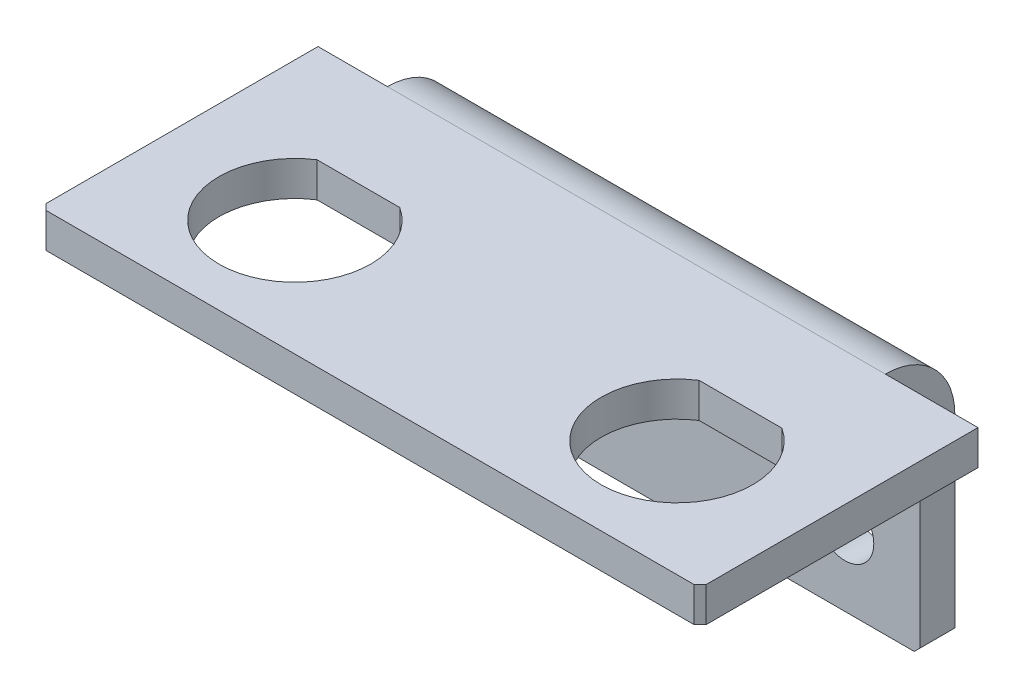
ISO-10303-21;
HEADER;
FILE_DESCRIPTION(('STEP AP214'),'2;1');
FILE_NAME('part.step','',(''),(''),'','','');
FILE_SCHEMA(('AUTOMOTIVE_DESIGN { 1 0 10303 214 1 1 1 1 }'));
ENDSEC;
DATA;
#1=APPLICATION_CONTEXT('core data for automotive mechanical design processes');
#2=APPLICATION_PROTOCOL_DEFINITION('international standard','automotive_design',2000,#1);
#3=PRODUCT_CONTEXT('',#1,'mechanical');
#4=PRODUCT('Part','Part','',(#3));
#5=PRODUCT_RELATED_PRODUCT_CATEGORY('part','',(#4));
#6=PRODUCT_DEFINITION_FORMATION('','',#4);
#7=PRODUCT_DEFINITION_CONTEXT('part definition',#1,'design');
#8=PRODUCT_DEFINITION('design','',#6,#7);
#9=PRODUCT_DEFINITION_SHAPE('','',#8);
#10=(LENGTH_UNIT() NAMED_UNIT(*) SI_UNIT(.MILLI.,.METRE.));
#11=(NAMED_UNIT(*) PLANE_ANGLE_UNIT() SI_UNIT($,.RADIAN.));
#12=(NAMED_UNIT(*) SI_UNIT($,.STERADIAN.) SOLID_ANGLE_UNIT());
#13=UNCERTAINTY_MEASURE_WITH_UNIT(LENGTH_MEASURE(1.E-05),#10,'distance_accuracy_value','');
#14=(GEOMETRIC_REPRESENTATION_CONTEXT(3) GLOBAL_UNCERTAINTY_ASSIGNED_CONTEXT((#13)) GLOBAL_UNIT_ASSIGNED_CONTEXT((#10,
#11,#12)) REPRESENTATION_CONTEXT('',''));
#15=CARTESIAN_POINT('',(0.,0.,0.));
#16=DIRECTION('',(0.,0.,1.));
#17=DIRECTION('',(1.,0.,0.));
#18=AXIS2_PLACEMENT_3D('',#15,#16,#17);
#19=CARTESIAN_POINT('',(21.373,0.127,-0.75));
#20=DIRECTION('',(0.707106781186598,-0.707106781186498,0.));
#21=DIRECTION('',(0.707106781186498,0.707106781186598,0.));
#22=AXIS2_PLACEMENT_3D('',#19,#20,#21);
#23=PLANE('',#22);
#24=DIRECTION('',(0.,0.,-1.));
#25=VECTOR('',#24,1.);
#26=CARTESIAN_POINT('',(21.5,0.254,-0.75));
#27=LINE('',#26,#25);
#28=CARTESIAN_POINT('',(21.5,0.254000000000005,0.));
#29=VERTEX_POINT('',#28);
#30=CARTESIAN_POINT('',(21.5,0.254,-1.5));
#31=VERTEX_POINT('',#30);
#32=EDGE_CURVE('E139',#29,#31,#27,.T.);
#33=ORIENTED_EDGE('',*,*,#32,.F.);
#34=DIRECTION('',(0.707106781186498,0.707106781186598,0.));
#35=VECTOR('',#34,1.);
#36=CARTESIAN_POINT('',(21.373,0.127,0.));
#37=LINE('',#36,#35);
#38=CARTESIAN_POINT('',(21.246,0.,0.));
#39=VERTEX_POINT('',#38);
#40=EDGE_CURVE('E144',#29,#39,#37,.F.);
#41=ORIENTED_EDGE('',*,*,#40,.T.);
#42=DIRECTION('',(0.,0.,-1.));
#43=VECTOR('',#42,1.);
#44=CARTESIAN_POINT('',(21.246,0.,-0.75));
#45=LINE('',#44,#43);
#46=CARTESIAN_POINT('',(21.246,0.,-1.5));
#47=VERTEX_POINT('',#46);
#48=EDGE_CURVE('E162',#47,#39,#45,.F.);
#49=ORIENTED_EDGE('',*,*,#48,.F.);
#50=DIRECTION('',(0.707106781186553,0.707106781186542,0.));
#51=VECTOR('',#50,1.);
#52=CARTESIAN_POINT('',(21.246,0.,-1.5));
#53=LINE('',#52,#51);
#54=EDGE_CURVE('E148',#47,#31,#53,.T.);
#55=ORIENTED_EDGE('',*,*,#54,.T.);
#56=EDGE_LOOP('',(#33,#41,#49,#55));
#57=FACE_BOUND('',#56,.T.);
#58=ADVANCED_FACE('F16',(#57),#23,.T.);
#59=CARTESIAN_POINT('',(0.127,0.127,-0.75));
#60=DIRECTION('',(-0.707106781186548,-0.707106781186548,0.));
#61=DIRECTION('',(0.707106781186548,-0.707106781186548,0.));
#62=AXIS2_PLACEMENT_3D('',#59,#60,#61);
#63=PLANE('',#62);
#64=DIRECTION('',(0.,0.,-1.));
#65=VECTOR('',#64,1.);
#66=CARTESIAN_POINT('',(0.254000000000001,0.,-0.75));
#67=LINE('',#66,#65);
#68=CARTESIAN_POINT('',(0.254,0.,0.));
#69=VERTEX_POINT('',#68);
#70=CARTESIAN_POINT('',(0.254,0.,-1.5));
#71=VERTEX_POINT('',#70);
#72=EDGE_CURVE('E157',#69,#71,#67,.T.);
#73=ORIENTED_EDGE('',*,*,#72,.F.);
#74=DIRECTION('',(0.707106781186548,-0.707106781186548,0.));
#75=VECTOR('',#74,1.);
#76=CARTESIAN_POINT('',(0.127,0.127,0.));
#77=LINE('',#76,#75);
#78=CARTESIAN_POINT('',(0.,0.254,0.));
#79=VERTEX_POINT('',#78);
#80=EDGE_CURVE('E147',#69,#79,#77,.F.);
#81=ORIENTED_EDGE('',*,*,#80,.T.);
#82=DIRECTION('',(0.,0.,1.));
#83=VECTOR('',#82,1.);
#84=CARTESIAN_POINT('',(0.,0.254,-0.75));
#85=LINE('',#84,#83);
#86=CARTESIAN_POINT('',(0.,0.254,-1.5));
#87=VERTEX_POINT('',#86);
#88=EDGE_CURVE('E107',#87,#79,#85,.T.);
#89=ORIENTED_EDGE('',*,*,#88,.F.);
#90=DIRECTION('',(0.707106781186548,-0.707106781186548,0.));
#91=VECTOR('',#90,1.);
#92=CARTESIAN_POINT('',(0.,0.254,-1.5));
#93=LINE('',#92,#91);
#94=EDGE_CURVE('E152',#87,#71,#93,.T.);
#95=ORIENTED_EDGE('',*,*,#94,.T.);
#96=EDGE_LOOP('',(#73,#81,#89,#95));
#97=FACE_BOUND('',#96,.T.);
#98=ADVANCED_FACE('F216',(#97),#63,.T.);
#99=CARTESIAN_POINT('',(0.,0.,-1.5));
#100=DIRECTION('',(0.,0.,1.));
#101=DIRECTION('',(1.,0.,0.));
#102=AXIS2_PLACEMENT_3D('',#99,#100,#101);
#103=PLANE('',#102);
#104=CARTESIAN_POINT('',(3.25,3.15,-1.5));
#105=DIRECTION('',(0.,0.,1.));
#106=DIRECTION('',(1.,0.,0.));
#107=AXIS2_PLACEMENT_3D('',#104,#105,#106);
#108=CIRCLE('',#107,1.25);
#109=CARTESIAN_POINT('',(4.5,3.15,-1.5));
#110=VERTEX_POINT('',#109);
#111=EDGE_CURVE('E194',#110,#110,#108,.T.);
#112=ORIENTED_EDGE('',*,*,#111,.T.);
#113=EDGE_LOOP('',(#112));
#114=FACE_BOUND('',#113,.T.);
#115=CARTESIAN_POINT('',(18.25,3.15,-1.5));
#116=DIRECTION('',(0.,0.,1.));
#117=DIRECTION('',(1.,0.,0.));
#118=AXIS2_PLACEMENT_3D('',#115,#116,#117);
#119=CIRCLE('',#118,1.25);
#120=CARTESIAN_POINT('',(19.5,3.15,-1.5));
#121=VERTEX_POINT('',#120);
#122=EDGE_CURVE('E19',#121,#121,#119,.T.);
#123=ORIENTED_EDGE('',*,*,#122,.T.);
#124=EDGE_LOOP('',(#123));
#125=FACE_BOUND('',#124,.T.);
#126=DIRECTION('',(0.,1.,0.));
#127=VECTOR('',#126,1.);
#128=CARTESIAN_POINT('',(0.,5.625,-1.5));
#129=LINE('',#128,#127);
#130=CARTESIAN_POINT('',(0.,8.25,-1.5));
#131=VERTEX_POINT('',#130);
#132=EDGE_CURVE('E138',#131,#87,#129,.F.);
#133=ORIENTED_EDGE('',*,*,#132,.F.);
#134=DIRECTION('',(-1.,0.,0.));
#135=VECTOR('',#134,1.);
#136=CARTESIAN_POINT('',(21.5,8.25,-1.5));
#137=LINE('',#136,#135);
#138=CARTESIAN_POINT('',(21.5,8.25,-1.5));
#139=VERTEX_POINT('',#138);
#140=EDGE_CURVE('E196',#139,#131,#137,.T.);
#141=ORIENTED_EDGE('',*,*,#140,.F.);
#142=DIRECTION('',(0.,1.,0.));
#143=VECTOR('',#142,1.);
#144=CARTESIAN_POINT('',(21.5,7.803097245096,-1.5));
#145=LINE('',#144,#143);
#146=EDGE_CURVE('E135',#139,#31,#145,.F.);
#147=ORIENTED_EDGE('',*,*,#146,.T.);
#148=ORIENTED_EDGE('',*,*,#54,.F.);
#149=DIRECTION('',(1.,0.,0.));
#150=VECTOR('',#149,1.);
#151=CARTESIAN_POINT('',(10.75,0.,-1.5));
#152=LINE('',#151,#150);
#153=EDGE_CURVE('E151',#71,#47,#152,.T.);
#154=ORIENTED_EDGE('',*,*,#153,.F.);
#155=ORIENTED_EDGE('',*,*,#94,.F.);
#156=EDGE_LOOP('',(#133,#141,#147,#148,#154,#155));
#157=FACE_BOUND('',#156,.T.);
#158=ADVANCED_FACE('F246',(#114,#125,#157),#103,.F.);
#159=CARTESIAN_POINT('',(10.75,0.,-0.75));
#160=DIRECTION('',(0.,-1.,0.));
#161=DIRECTION('',(0.,0.,-1.));
#162=AXIS2_PLACEMENT_3D('',#159,#160,#161);
#163=PLANE('',#162);
#164=DIRECTION('',(1.,0.,0.));
#165=VECTOR('',#164,1.);
#166=CARTESIAN_POINT('',(0.,0.,0.));
#167=LINE('',#166,#165);
#168=EDGE_CURVE('E143',#69,#39,#167,.T.);
#169=ORIENTED_EDGE('',*,*,#168,.F.);
#170=ORIENTED_EDGE('',*,*,#72,.T.);
#171=ORIENTED_EDGE('',*,*,#153,.T.);
#172=ORIENTED_EDGE('',*,*,#48,.T.);
#173=EDGE_LOOP('',(#169,#170,#171,#172));
#174=FACE_BOUND('',#173,.T.);
#175=ADVANCED_FACE('F251',(#174),#163,.T.);
#176=CARTESIAN_POINT('',(18.25,3.15,-3.15));
#177=DIRECTION('',(0.,0.,1.));
#178=DIRECTION('',(1.,0.,0.));
#179=AXIS2_PLACEMENT_3D('',#176,#177,#178);
#180=CYLINDRICAL_SURFACE('',#179,1.25);
#181=ORIENTED_EDGE('',*,*,#122,.F.);
#182=EDGE_LOOP('',(#181));
#183=FACE_BOUND('',#182,.T.);
#184=CARTESIAN_POINT('',(18.25,3.15,0.));
#185=DIRECTION('',(0.,0.,1.));
#186=DIRECTION('',(1.,0.,0.));
#187=AXIS2_PLACEMENT_3D('',#184,#185,#186);
#188=CIRCLE('',#187,1.25);
#189=CARTESIAN_POINT('',(19.5,3.15,0.));
#190=VERTEX_POINT('',#189);
#191=EDGE_CURVE('E111',#190,#190,#188,.F.);
#192=ORIENTED_EDGE('',*,*,#191,.F.);
#193=EDGE_LOOP('',(#192));
#194=FACE_BOUND('',#193,.T.);
#195=ADVANCED_FACE('F449',(#183,#194),#180,.F.);
#196=CARTESIAN_POINT('',(3.25,3.15,-3.154987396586));
#197=DIRECTION('',(0.,0.,1.));
#198=DIRECTION('',(1.,0.,0.));
#199=AXIS2_PLACEMENT_3D('',#196,#197,#198);
#200=CYLINDRICAL_SURFACE('',#199,1.25);
#201=ORIENTED_EDGE('',*,*,#111,.F.);
#202=EDGE_LOOP('',(#201));
#203=FACE_BOUND('',#202,.T.);
#204=CARTESIAN_POINT('',(3.25,3.15,0.));
#205=DIRECTION('',(0.,0.,1.));
#206=DIRECTION('',(1.,0.,0.));
#207=AXIS2_PLACEMENT_3D('',#204,#205,#206);
#208=CIRCLE('',#207,1.25);
#209=CARTESIAN_POINT('',(4.5,3.15,0.));
#210=VERTEX_POINT('',#209);
#211=EDGE_CURVE('E182',#210,#210,#208,.F.);
#212=ORIENTED_EDGE('',*,*,#211,.F.);
#213=EDGE_LOOP('',(#212));
#214=FACE_BOUND('',#213,.T.);
#215=ADVANCED_FACE('F443',(#203,#214),#200,.F.);
#216=CARTESIAN_POINT('',(21.5,8.25,1.5));
#217=DIRECTION('',(-1.,0.,0.));
#218=DIRECTION('',(0.,0.,1.));
#219=AXIS2_PLACEMENT_3D('',#216,#217,#218);
#220=CYLINDRICAL_SURFACE('',#219,3.);
#221=ORIENTED_EDGE('',*,*,#140,.T.);
#222=CARTESIAN_POINT('',(0.,8.25,1.5));
#223=DIRECTION('',(-1.,0.,0.));
#224=DIRECTION('',(0.,0.,1.));
#225=AXIS2_PLACEMENT_3D('',#222,#223,#224);
#226=CIRCLE('',#225,3.);
#227=CARTESIAN_POINT('',(0.,11.25,1.5));
#228=VERTEX_POINT('',#227);
#229=EDGE_CURVE('E191',#131,#228,#226,.F.);
#230=ORIENTED_EDGE('',*,*,#229,.T.);
#231=DIRECTION('',(1.,0.,0.));
#232=VECTOR('',#231,1.);
#233=CARTESIAN_POINT('',(0.,11.25,1.5));
#234=LINE('',#233,#232);
#235=CARTESIAN_POINT('',(21.5,11.25,1.5));
#236=VERTEX_POINT('',#235);
#237=EDGE_CURVE('E257',#236,#228,#234,.F.);
#238=ORIENTED_EDGE('',*,*,#237,.F.);
#239=CARTESIAN_POINT('',(21.5,8.25,1.5));
#240=DIRECTION('',(-1.,0.,0.));
#241=DIRECTION('',(0.,0.,1.));
#242=AXIS2_PLACEMENT_3D('',#239,#240,#241);
#243=CIRCLE('',#242,3.);
#244=EDGE_CURVE('E188',#139,#236,#243,.F.);
#245=ORIENTED_EDGE('',*,*,#244,.F.);
#246=EDGE_LOOP('',(#221,#230,#238,#245));
#247=FACE_BOUND('',#246,.T.);
#248=ADVANCED_FACE('F255',(#247),#220,.T.);
#249=CARTESIAN_POINT('',(25.373,10.5,13.373));
#250=DIRECTION('',(0.707106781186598,0.,0.707106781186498));
#251=DIRECTION('',(0.707106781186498,0.,-0.707106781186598));
#252=AXIS2_PLACEMENT_3D('',#249,#250,#251);
#253=PLANE('',#252);
#254=DIRECTION('',(0.,1.,0.));
#255=VECTOR('',#254,1.);
#256=CARTESIAN_POINT('',(25.5,10.5,13.246));
#257=LINE('',#256,#255);
#258=CARTESIAN_POINT('',(25.5,11.25,13.246));
#259=VERTEX_POINT('',#258);
#260=CARTESIAN_POINT('',(25.5,9.75,13.246));
#261=VERTEX_POINT('',#260);
#262=EDGE_CURVE('E280',#259,#261,#257,.F.);
#263=ORIENTED_EDGE('',*,*,#262,.F.);
#264=DIRECTION('',(0.707106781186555,0.,-0.70710678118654));
#265=VECTOR('',#264,1.);
#266=CARTESIAN_POINT('',(25.246,11.25,13.5));
#267=LINE('',#266,#265);
#268=CARTESIAN_POINT('',(25.246,11.25,13.5));
#269=VERTEX_POINT('',#268);
#270=EDGE_CURVE('E263',#269,#259,#267,.T.);
#271=ORIENTED_EDGE('',*,*,#270,.F.);
#272=DIRECTION('',(0.,1.,0.));
#273=VECTOR('',#272,1.);
#274=CARTESIAN_POINT('',(25.246,10.5,13.5));
#275=LINE('',#274,#273);
#276=CARTESIAN_POINT('',(25.246,9.75,13.5));
#277=VERTEX_POINT('',#276);
#278=EDGE_CURVE('E309',#277,#269,#275,.T.);
#279=ORIENTED_EDGE('',*,*,#278,.F.);
#280=DIRECTION('',(0.707106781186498,0.,-0.707106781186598));
#281=VECTOR('',#280,1.);
#282=CARTESIAN_POINT('',(25.373,9.75,13.373));
#283=LINE('',#282,#281);
#284=EDGE_CURVE('E193',#277,#261,#283,.T.);
#285=ORIENTED_EDGE('',*,*,#284,.T.);
#286=EDGE_LOOP('',(#263,#271,#279,#285));
#287=FACE_BOUND('',#286,.T.);
#288=ADVANCED_FACE('F427',(#287),#253,.T.);
#289=CARTESIAN_POINT('',(0.,9.856191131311,-0.75));
#290=DIRECTION('',(1.,0.,0.));
#291=DIRECTION('',(0.,0.,-1.));
#292=AXIS2_PLACEMENT_3D('',#289,#290,#291);
#293=PLANE('',#292);
#294=ORIENTED_EDGE('',*,*,#229,.F.);
#295=ORIENTED_EDGE('',*,*,#132,.T.);
#296=ORIENTED_EDGE('',*,*,#88,.T.);
#297=DIRECTION('',(0.,1.,0.));
#298=VECTOR('',#297,1.);
#299=CARTESIAN_POINT('',(0.,0.,0.));
#300=LINE('',#299,#298);
#301=CARTESIAN_POINT('',(0.,8.25,0.));
#302=VERTEX_POINT('',#301);
#303=EDGE_CURVE('E98',#302,#79,#300,.F.);
#304=ORIENTED_EDGE('',*,*,#303,.F.);
#305=CARTESIAN_POINT('',(0.,8.25,1.5));
#306=DIRECTION('',(-1.,0.,0.));
#307=DIRECTION('',(0.,0.,1.));
#308=AXIS2_PLACEMENT_3D('',#305,#306,#307);
#309=CIRCLE('',#308,1.5);
#310=CARTESIAN_POINT('',(0.,9.75,1.5));
#311=VERTEX_POINT('',#310);
#312=EDGE_CURVE('E102',#302,#311,#309,.F.);
#313=ORIENTED_EDGE('',*,*,#312,.T.);
#314=DIRECTION('',(0.,1.,0.));
#315=VECTOR('',#314,1.);
#316=CARTESIAN_POINT('',(0.,9.856191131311,1.5));
#317=LINE('',#316,#315);
#318=EDGE_CURVE('E190',#228,#311,#317,.F.);
#319=ORIENTED_EDGE('',*,*,#318,.F.);
#320=EDGE_LOOP('',(#294,#295,#296,#304,#313,#319));
#321=FACE_BOUND('',#320,.T.);
#322=ADVANCED_FACE('F101',(#321),#293,.F.);
#323=CARTESIAN_POINT('',(21.5,9.856191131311,-0.75));
#324=DIRECTION('',(1.,0.,0.));
#325=DIRECTION('',(0.,0.,-1.));
#326=AXIS2_PLACEMENT_3D('',#323,#324,#325);
#327=PLANE('',#326);
#328=DIRECTION('',(0.,1.,0.));
#329=VECTOR('',#328,1.);
#330=CARTESIAN_POINT('',(21.5,10.5,1.5));
#331=LINE('',#330,#329);
#332=CARTESIAN_POINT('',(21.5,9.75,1.5));
#333=VERTEX_POINT('',#332);
#334=EDGE_CURVE('E121',#236,#333,#331,.F.);
#335=ORIENTED_EDGE('',*,*,#334,.T.);
#336=CARTESIAN_POINT('',(21.5,8.25,1.5));
#337=DIRECTION('',(-1.,0.,0.));
#338=DIRECTION('',(0.,0.,1.));
#339=AXIS2_PLACEMENT_3D('',#336,#337,#338);
#340=CIRCLE('',#339,1.5);
#341=CARTESIAN_POINT('',(21.5,8.25,0.));
#342=VERTEX_POINT('',#341);
#343=EDGE_CURVE('E89',#333,#342,#340,.T.);
#344=ORIENTED_EDGE('',*,*,#343,.T.);
#345=DIRECTION('',(0.,1.,0.));
#346=VECTOR('',#345,1.);
#347=CARTESIAN_POINT('',(21.5,0.,0.));
#348=LINE('',#347,#346);
#349=EDGE_CURVE('E112',#29,#342,#348,.T.);
#350=ORIENTED_EDGE('',*,*,#349,.F.);
#351=ORIENTED_EDGE('',*,*,#32,.T.);
#352=ORIENTED_EDGE('',*,*,#146,.F.);
#353=ORIENTED_EDGE('',*,*,#244,.T.);
#354=EDGE_LOOP('',(#335,#344,#350,#351,#352,#353));
#355=FACE_BOUND('',#354,.T.);
#356=ADVANCED_FACE('F252',(#355),#327,.T.);
#357=CARTESIAN_POINT('',(0.,0.,0.));
#358=DIRECTION('',(0.,0.,1.));
#359=DIRECTION('',(1.,0.,0.));
#360=AXIS2_PLACEMENT_3D('',#357,#358,#359);
#361=PLANE('',#360);
#362=ORIENTED_EDGE('',*,*,#211,.T.);
#363=EDGE_LOOP('',(#362));
#364=FACE_BOUND('',#363,.T.);
#365=ORIENTED_EDGE('',*,*,#191,.T.);
#366=EDGE_LOOP('',(#365));
#367=FACE_BOUND('',#366,.T.);
#368=ORIENTED_EDGE('',*,*,#303,.T.);
#369=ORIENTED_EDGE('',*,*,#80,.F.);
#370=ORIENTED_EDGE('',*,*,#168,.T.);
#371=ORIENTED_EDGE('',*,*,#40,.F.);
#372=ORIENTED_EDGE('',*,*,#349,.T.);
#373=DIRECTION('',(-1.,0.,0.));
#374=VECTOR('',#373,1.);
#375=CARTESIAN_POINT('',(21.5,8.25,0.));
#376=LINE('',#375,#374);
#377=EDGE_CURVE('E118',#342,#302,#376,.T.);
#378=ORIENTED_EDGE('',*,*,#377,.T.);
#379=EDGE_LOOP('',(#368,#369,#370,#371,#372,#378));
#380=FACE_BOUND('',#379,.T.);
#381=ADVANCED_FACE('F123',(#364,#367,#380),#361,.T.);
#382=CARTESIAN_POINT('',(-2.873,10.5,13.373));
#383=DIRECTION('',(-0.707106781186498,0.,0.707106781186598));
#384=DIRECTION('',(0.707106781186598,0.,0.707106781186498));
#385=AXIS2_PLACEMENT_3D('',#382,#383,#384);
#386=PLANE('',#385);
#387=DIRECTION('',(0.,1.,0.));
#388=VECTOR('',#387,1.);
#389=CARTESIAN_POINT('',(-2.746,10.5,13.5));
#390=LINE('',#389,#388);
#391=CARTESIAN_POINT('',(-2.746,11.25,13.5));
#392=VERTEX_POINT('',#391);
#393=CARTESIAN_POINT('',(-2.746,9.75,13.5));
#394=VERTEX_POINT('',#393);
#395=EDGE_CURVE('E291',#392,#394,#390,.F.);
#396=ORIENTED_EDGE('',*,*,#395,.F.);
#397=DIRECTION('',(0.707106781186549,0.,0.707106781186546));
#398=VECTOR('',#397,1.);
#399=CARTESIAN_POINT('',(-3.,11.25,13.246));
#400=LINE('',#399,#398);
#401=CARTESIAN_POINT('',(-3.,11.25,13.246));
#402=VERTEX_POINT('',#401);
#403=EDGE_CURVE('E262',#402,#392,#400,.T.);
#404=ORIENTED_EDGE('',*,*,#403,.F.);
#405=DIRECTION('',(0.,1.,0.));
#406=VECTOR('',#405,1.);
#407=CARTESIAN_POINT('',(-3.,10.5,13.246));
#408=LINE('',#407,#406);
#409=CARTESIAN_POINT('',(-3.,9.75,13.246));
#410=VERTEX_POINT('',#409);
#411=EDGE_CURVE('E180',#410,#402,#408,.T.);
#412=ORIENTED_EDGE('',*,*,#411,.F.);
#413=DIRECTION('',(0.707106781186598,0.,0.707106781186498));
#414=VECTOR('',#413,1.);
#415=CARTESIAN_POINT('',(-2.873,9.75,13.373));
#416=LINE('',#415,#414);
#417=EDGE_CURVE('E185',#410,#394,#416,.T.);
#418=ORIENTED_EDGE('',*,*,#417,.T.);
#419=EDGE_LOOP('',(#396,#404,#412,#418));
#420=FACE_BOUND('',#419,.T.);
#421=ADVANCED_FACE('F354',(#420),#386,.T.);
#422=CARTESIAN_POINT('',(0.,11.25,-1.5));
#423=DIRECTION('',(0.,1.,0.));
#424=DIRECTION('',(0.,0.,1.));
#425=AXIS2_PLACEMENT_3D('',#422,#423,#424);
#426=PLANE('',#425);
#427=DIRECTION('',(-1.,0.,0.));
#428=VECTOR('',#427,1.);
#429=CARTESIAN_POINT('',(3.,11.25,5.755));
#430=LINE('',#429,#428);
#431=CARTESIAN_POINT('',(1.21377493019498,11.25,5.755));
#432=VERTEX_POINT('',#431);
#433=CARTESIAN_POINT('',(4.78622506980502,11.25,5.755));
#434=VERTEX_POINT('',#433);
#435=EDGE_CURVE('E325',#432,#434,#430,.F.);
#436=ORIENTED_EDGE('',*,*,#435,.T.);
#437=CARTESIAN_POINT('',(3.,11.25,8.5));
#438=DIRECTION('',(0.,1.,0.));
#439=DIRECTION('',(0.,0.,1.));
#440=AXIS2_PLACEMENT_3D('',#437,#438,#439);
#441=CIRCLE('',#440,3.275);
#442=EDGE_CURVE('E174',#434,#432,#441,.F.);
#443=ORIENTED_EDGE('',*,*,#442,.T.);
#444=EDGE_LOOP('',(#436,#443));
#445=FACE_BOUND('',#444,.T.);
#446=DIRECTION('',(-1.,0.,0.));
#447=VECTOR('',#446,1.);
#448=CARTESIAN_POINT('',(19.5,11.25,5.755));
#449=LINE('',#448,#447);
#450=CARTESIAN_POINT('',(17.7137749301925,11.25,5.755));
#451=VERTEX_POINT('',#450);
#452=CARTESIAN_POINT('',(21.2862250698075,11.25,5.755));
#453=VERTEX_POINT('',#452);
#454=EDGE_CURVE('E331',#451,#453,#449,.F.);
#455=ORIENTED_EDGE('',*,*,#454,.T.);
#456=CARTESIAN_POINT('',(19.5,11.25,8.5));
#457=DIRECTION('',(0.,1.,0.));
#458=DIRECTION('',(0.,0.,1.));
#459=AXIS2_PLACEMENT_3D('',#456,#457,#458);
#460=CIRCLE('',#459,3.275);
#461=EDGE_CURVE('E178',#453,#451,#460,.F.);
#462=ORIENTED_EDGE('',*,*,#461,.T.);
#463=EDGE_LOOP('',(#455,#462));
#464=FACE_BOUND('',#463,.T.);
#465=DIRECTION('',(0.,0.,1.));
#466=VECTOR('',#465,1.);
#467=CARTESIAN_POINT('',(-3.,11.25,6.));
#468=LINE('',#467,#466);
#469=CARTESIAN_POINT('',(-3.,11.25,1.5));
#470=VERTEX_POINT('',#469);
#471=EDGE_CURVE('E128',#402,#470,#468,.F.);
#472=ORIENTED_EDGE('',*,*,#471,.F.);
#473=ORIENTED_EDGE('',*,*,#403,.T.);
#474=DIRECTION('',(1.,0.,0.));
#475=VECTOR('',#474,1.);
#476=CARTESIAN_POINT('',(11.25,11.25,13.5));
#477=LINE('',#476,#475);
#478=EDGE_CURVE('E311',#269,#392,#477,.F.);
#479=ORIENTED_EDGE('',*,*,#478,.F.);
#480=ORIENTED_EDGE('',*,*,#270,.T.);
#481=DIRECTION('',(0.,0.,-1.));
#482=VECTOR('',#481,1.);
#483=CARTESIAN_POINT('',(25.5,11.25,6.));
#484=LINE('',#483,#482);
#485=CARTESIAN_POINT('',(25.5,11.25,1.5));
#486=VERTEX_POINT('',#485);
#487=EDGE_CURVE('E277',#486,#259,#484,.F.);
#488=ORIENTED_EDGE('',*,*,#487,.F.);
#489=DIRECTION('',(1.,0.,0.));
#490=VECTOR('',#489,1.);
#491=CARTESIAN_POINT('',(23.5,11.25,1.5));
#492=LINE('',#491,#490);
#493=EDGE_CURVE('E269',#486,#236,#492,.F.);
#494=ORIENTED_EDGE('',*,*,#493,.T.);
#495=ORIENTED_EDGE('',*,*,#237,.T.);
#496=DIRECTION('',(-1.,0.,0.));
#497=VECTOR('',#496,1.);
#498=CARTESIAN_POINT('',(-1.5,11.25,1.5));
#499=LINE('',#498,#497);
#500=EDGE_CURVE('E125',#470,#228,#499,.F.);
#501=ORIENTED_EDGE('',*,*,#500,.F.);
#502=EDGE_LOOP('',(#472,#473,#479,#480,#488,#494,#495,#501));
#503=FACE_BOUND('',#502,.T.);
#504=ADVANCED_FACE('F275',(#445,#464,#503),#426,.T.);
#505=CARTESIAN_POINT('',(11.25,10.5,13.5));
#506=DIRECTION('',(0.,0.,1.));
#507=DIRECTION('',(1.,0.,0.));
#508=AXIS2_PLACEMENT_3D('',#505,#506,#507);
#509=PLANE('',#508);
#510=ORIENTED_EDGE('',*,*,#478,.T.);
#511=ORIENTED_EDGE('',*,*,#395,.T.);
#512=DIRECTION('',(1.,0.,0.));
#513=VECTOR('',#512,1.);
#514=CARTESIAN_POINT('',(0.,9.75,13.5));
#515=LINE('',#514,#513);
#516=EDGE_CURVE('E297',#394,#277,#515,.T.);
#517=ORIENTED_EDGE('',*,*,#516,.T.);
#518=ORIENTED_EDGE('',*,*,#278,.T.);
#519=EDGE_LOOP('',(#510,#511,#517,#518));
#520=FACE_BOUND('',#519,.T.);
#521=ADVANCED_FACE('F382',(#520),#509,.T.);
#522=CARTESIAN_POINT('',(25.5,10.5,6.));
#523=DIRECTION('',(1.,0.,0.));
#524=DIRECTION('',(0.,0.,-1.));
#525=AXIS2_PLACEMENT_3D('',#522,#523,#524);
#526=PLANE('',#525);
#527=ORIENTED_EDGE('',*,*,#487,.T.);
#528=ORIENTED_EDGE('',*,*,#262,.T.);
#529=DIRECTION('',(0.,0.,1.));
#530=VECTOR('',#529,1.);
#531=CARTESIAN_POINT('',(25.5,9.75,-1.5));
#532=LINE('',#531,#530);
#533=CARTESIAN_POINT('',(25.5,9.75,1.5));
#534=VERTEX_POINT('',#533);
#535=EDGE_CURVE('E294',#261,#534,#532,.F.);
#536=ORIENTED_EDGE('',*,*,#535,.T.);
#537=DIRECTION('',(0.,1.,0.));
#538=VECTOR('',#537,1.);
#539=CARTESIAN_POINT('',(25.5,10.5,1.5));
#540=LINE('',#539,#538);
#541=EDGE_CURVE('E278',#534,#486,#540,.T.);
#542=ORIENTED_EDGE('',*,*,#541,.T.);
#543=EDGE_LOOP('',(#527,#528,#536,#542));
#544=FACE_BOUND('',#543,.T.);
#545=ADVANCED_FACE('F390',(#544),#526,.T.);
#546=CARTESIAN_POINT('',(23.5,10.5,1.5));
#547=DIRECTION('',(0.,0.,1.));
#548=DIRECTION('',(1.,0.,0.));
#549=AXIS2_PLACEMENT_3D('',#546,#547,#548);
#550=PLANE('',#549);
#551=ORIENTED_EDGE('',*,*,#493,.F.);
#552=ORIENTED_EDGE('',*,*,#541,.F.);
#553=DIRECTION('',(1.,0.,0.));
#554=VECTOR('',#553,1.);
#555=CARTESIAN_POINT('',(0.,9.75,1.5));
#556=LINE('',#555,#554);
#557=EDGE_CURVE('E272',#534,#333,#556,.F.);
#558=ORIENTED_EDGE('',*,*,#557,.T.);
#559=ORIENTED_EDGE('',*,*,#334,.F.);
#560=EDGE_LOOP('',(#551,#552,#558,#559));
#561=FACE_BOUND('',#560,.T.);
#562=ADVANCED_FACE('F268',(#561),#550,.F.);
#563=CARTESIAN_POINT('',(21.5,8.25,1.5));
#564=DIRECTION('',(-1.,0.,0.));
#565=DIRECTION('',(0.,0.,1.));
#566=AXIS2_PLACEMENT_3D('',#563,#564,#565);
#567=CYLINDRICAL_SURFACE('',#566,1.5);
#568=ORIENTED_EDGE('',*,*,#377,.F.);
#569=ORIENTED_EDGE('',*,*,#343,.F.);
#570=DIRECTION('',(1.,0.,0.));
#571=VECTOR('',#570,1.);
#572=CARTESIAN_POINT('',(0.,9.75,1.5));
#573=LINE('',#572,#571);
#574=EDGE_CURVE('E120',#333,#311,#573,.F.);
#575=ORIENTED_EDGE('',*,*,#574,.T.);
#576=ORIENTED_EDGE('',*,*,#312,.F.);
#577=EDGE_LOOP('',(#568,#569,#575,#576));
#578=FACE_BOUND('',#577,.T.);
#579=ADVANCED_FACE('F117',(#578),#567,.F.);
#580=CARTESIAN_POINT('',(-1.5,10.5,1.5));
#581=DIRECTION('',(0.,0.,-1.));
#582=DIRECTION('',(-1.,0.,0.));
#583=AXIS2_PLACEMENT_3D('',#580,#581,#582);
#584=PLANE('',#583);
#585=ORIENTED_EDGE('',*,*,#318,.T.);
#586=DIRECTION('',(1.,0.,0.));
#587=VECTOR('',#586,1.);
#588=CARTESIAN_POINT('',(0.,9.75,1.5));
#589=LINE('',#588,#587);
#590=CARTESIAN_POINT('',(-3.,9.75,1.5));
#591=VERTEX_POINT('',#590);
#592=EDGE_CURVE('E284',#311,#591,#589,.F.);
#593=ORIENTED_EDGE('',*,*,#592,.T.);
#594=DIRECTION('',(0.,1.,0.));
#595=VECTOR('',#594,1.);
#596=CARTESIAN_POINT('',(-3.,10.5,1.5));
#597=LINE('',#596,#595);
#598=EDGE_CURVE('E345',#470,#591,#597,.F.);
#599=ORIENTED_EDGE('',*,*,#598,.F.);
#600=ORIENTED_EDGE('',*,*,#500,.T.);
#601=EDGE_LOOP('',(#585,#593,#599,#600));
#602=FACE_BOUND('',#601,.T.);
#603=ADVANCED_FACE('F342',(#602),#584,.T.);
#604=CARTESIAN_POINT('',(-3.,10.5,6.));
#605=DIRECTION('',(-1.,0.,0.));
#606=DIRECTION('',(0.,0.,1.));
#607=AXIS2_PLACEMENT_3D('',#604,#605,#606);
#608=PLANE('',#607);
#609=DIRECTION('',(0.,0.,1.));
#610=VECTOR('',#609,1.);
#611=CARTESIAN_POINT('',(-3.,9.75,-1.5));
#612=LINE('',#611,#610);
#613=EDGE_CURVE('E173',#591,#410,#612,.T.);
#614=ORIENTED_EDGE('',*,*,#613,.T.);
#615=ORIENTED_EDGE('',*,*,#411,.T.);
#616=ORIENTED_EDGE('',*,*,#471,.T.);
#617=ORIENTED_EDGE('',*,*,#598,.T.);
#618=EDGE_LOOP('',(#614,#615,#616,#617));
#619=FACE_BOUND('',#618,.T.);
#620=ADVANCED_FACE('F356',(#619),#608,.T.);
#621=CARTESIAN_POINT('',(19.5,10.5,8.5));
#622=DIRECTION('',(0.,1.,0.));
#623=DIRECTION('',(0.,0.,1.));
#624=AXIS2_PLACEMENT_3D('',#621,#622,#623);
#625=CYLINDRICAL_SURFACE('',#624,3.275);
#626=ORIENTED_EDGE('',*,*,#461,.F.);
#627=DIRECTION('',(0.,1.,0.));
#628=VECTOR('',#627,1.);
#629=CARTESIAN_POINT('',(21.28622506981,10.5,5.755));
#630=LINE('',#629,#628);
#631=CARTESIAN_POINT('',(21.2862250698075,9.75,5.755));
#632=VERTEX_POINT('',#631);
#633=EDGE_CURVE('E177',#453,#632,#630,.F.);
#634=ORIENTED_EDGE('',*,*,#633,.T.);
#635=CARTESIAN_POINT('',(19.5,9.75,8.5));
#636=DIRECTION('',(0.,1.,0.));
#637=DIRECTION('',(0.,0.,1.));
#638=AXIS2_PLACEMENT_3D('',#635,#636,#637);
#639=CIRCLE('',#638,3.275);
#640=CARTESIAN_POINT('',(17.7137749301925,9.75,5.755));
#641=VERTEX_POINT('',#640);
#642=EDGE_CURVE('E171',#632,#641,#639,.F.);
#643=ORIENTED_EDGE('',*,*,#642,.T.);
#644=DIRECTION('',(0.,1.,0.));
#645=VECTOR('',#644,1.);
#646=CARTESIAN_POINT('',(17.71377493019,10.5,5.755));
#647=LINE('',#646,#645);
#648=EDGE_CURVE('E179',#641,#451,#647,.T.);
#649=ORIENTED_EDGE('',*,*,#648,.T.);
#650=EDGE_LOOP('',(#626,#634,#643,#649));
#651=FACE_BOUND('',#650,.T.);
#652=ADVANCED_FACE('F379',(#651),#625,.F.);
#653=CARTESIAN_POINT('',(19.5,10.5,5.755));
#654=DIRECTION('',(0.,0.,-1.));
#655=DIRECTION('',(-1.,0.,0.));
#656=AXIS2_PLACEMENT_3D('',#653,#654,#655);
#657=PLANE('',#656);
#658=ORIENTED_EDGE('',*,*,#454,.F.);
#659=ORIENTED_EDGE('',*,*,#648,.F.);
#660=DIRECTION('',(1.,0.,0.));
#661=VECTOR('',#660,1.);
#662=CARTESIAN_POINT('',(0.,9.75,5.755));
#663=LINE('',#662,#661);
#664=EDGE_CURVE('E170',#641,#632,#663,.T.);
#665=ORIENTED_EDGE('',*,*,#664,.T.);
#666=ORIENTED_EDGE('',*,*,#633,.F.);
#667=EDGE_LOOP('',(#658,#659,#665,#666));
#668=FACE_BOUND('',#667,.T.);
#669=ADVANCED_FACE('F374',(#668),#657,.F.);
#670=CARTESIAN_POINT('',(3.,10.5,8.5));
#671=DIRECTION('',(0.,1.,0.));
#672=DIRECTION('',(0.,0.,1.));
#673=AXIS2_PLACEMENT_3D('',#670,#671,#672);
#674=CYLINDRICAL_SURFACE('',#673,3.275);
#675=ORIENTED_EDGE('',*,*,#442,.F.);
#676=DIRECTION('',(0.,1.,0.));
#677=VECTOR('',#676,1.);
#678=CARTESIAN_POINT('',(4.786225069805,10.5,5.755));
#679=LINE('',#678,#677);
#680=CARTESIAN_POINT('',(4.78622506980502,9.75,5.755));
#681=VERTEX_POINT('',#680);
#682=EDGE_CURVE('E328',#434,#681,#679,.F.);
#683=ORIENTED_EDGE('',*,*,#682,.T.);
#684=CARTESIAN_POINT('',(3.,9.75,8.5));
#685=DIRECTION('',(0.,1.,0.));
#686=DIRECTION('',(0.,0.,1.));
#687=AXIS2_PLACEMENT_3D('',#684,#685,#686);
#688=CIRCLE('',#687,3.275);
#689=CARTESIAN_POINT('',(1.21377493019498,9.75,5.755));
#690=VERTEX_POINT('',#689);
#691=EDGE_CURVE('E25',#681,#690,#688,.F.);
#692=ORIENTED_EDGE('',*,*,#691,.T.);
#693=DIRECTION('',(0.,1.,0.));
#694=VECTOR('',#693,1.);
#695=CARTESIAN_POINT('',(1.213774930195,10.5,5.755));
#696=LINE('',#695,#694);
#697=EDGE_CURVE('E176',#690,#432,#696,.T.);
#698=ORIENTED_EDGE('',*,*,#697,.T.);
#699=EDGE_LOOP('',(#675,#683,#692,#698));
#700=FACE_BOUND('',#699,.T.);
#701=ADVANCED_FACE('F400',(#700),#674,.F.);
#702=CARTESIAN_POINT('',(3.,10.5,5.755));
#703=DIRECTION('',(0.,0.,-1.));
#704=DIRECTION('',(-1.,0.,0.));
#705=AXIS2_PLACEMENT_3D('',#702,#703,#704);
#706=PLANE('',#705);
#707=ORIENTED_EDGE('',*,*,#435,.F.);
#708=ORIENTED_EDGE('',*,*,#697,.F.);
#709=DIRECTION('',(1.,0.,0.));
#710=VECTOR('',#709,1.);
#711=CARTESIAN_POINT('',(0.,9.75,5.755));
#712=LINE('',#711,#710);
#713=EDGE_CURVE('E11',#690,#681,#712,.T.);
#714=ORIENTED_EDGE('',*,*,#713,.T.);
#715=ORIENTED_EDGE('',*,*,#682,.F.);
#716=EDGE_LOOP('',(#707,#708,#714,#715));
#717=FACE_BOUND('',#716,.T.);
#718=ADVANCED_FACE('F394',(#717),#706,.F.);
#719=CARTESIAN_POINT('',(0.,9.75,-1.5));
#720=DIRECTION('',(0.,1.,0.));
#721=DIRECTION('',(0.,0.,1.));
#722=AXIS2_PLACEMENT_3D('',#719,#720,#721);
#723=PLANE('',#722);
#724=ORIENTED_EDGE('',*,*,#713,.F.);
#725=ORIENTED_EDGE('',*,*,#691,.F.);
#726=EDGE_LOOP('',(#724,#725));
#727=FACE_BOUND('',#726,.T.);
#728=ORIENTED_EDGE('',*,*,#664,.F.);
#729=ORIENTED_EDGE('',*,*,#642,.F.);
#730=EDGE_LOOP('',(#728,#729));
#731=FACE_BOUND('',#730,.T.);
#732=ORIENTED_EDGE('',*,*,#592,.F.);
#733=ORIENTED_EDGE('',*,*,#574,.F.);
#734=ORIENTED_EDGE('',*,*,#557,.F.);
#735=ORIENTED_EDGE('',*,*,#535,.F.);
#736=ORIENTED_EDGE('',*,*,#284,.F.);
#737=ORIENTED_EDGE('',*,*,#516,.F.);
#738=ORIENTED_EDGE('',*,*,#417,.F.);
#739=ORIENTED_EDGE('',*,*,#613,.F.);
#740=EDGE_LOOP('',(#732,#733,#734,#735,#736,#737,#738,#739));
#741=FACE_BOUND('',#740,.T.);
#742=ADVANCED_FACE('F376',(#727,#731,#741),#723,.F.);
#743=CLOSED_SHELL('',(#58,#98,#158,#175,#195,#215,#248,#288,#322,#356,#381,#421,#504,#521,#545,
#562,#579,#603,#620,#652,#669,#701,#718,#742));
#744=MANIFOLD_SOLID_BREP('B1',#743);
#745=ADVANCED_BREP_SHAPE_REPRESENTATION('',(#18,#744),#14);
#746=SHAPE_DEFINITION_REPRESENTATION(#9,#745);
ENDSEC;
END-ISO-10303-21;
